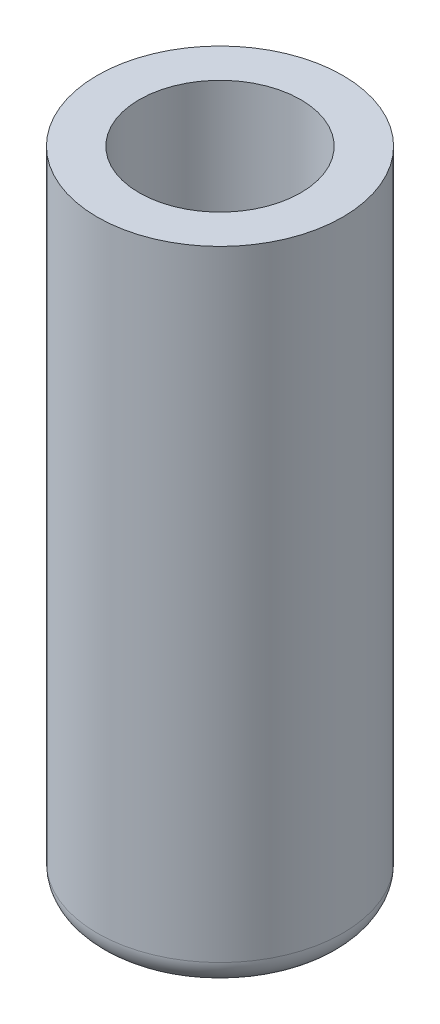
ISO-10303-21;
HEADER;
FILE_DESCRIPTION(('STEP AP214'),'2;1');
FILE_NAME('part.step','',(''),(''),'','','');
FILE_SCHEMA(('AUTOMOTIVE_DESIGN { 1 0 10303 214 1 1 1 1 }'));
ENDSEC;
DATA;
#1=APPLICATION_CONTEXT('core data for automotive mechanical design processes');
#2=APPLICATION_PROTOCOL_DEFINITION('international standard','automotive_design',2000,#1);
#3=PRODUCT_CONTEXT('',#1,'mechanical');
#4=PRODUCT('Part','Part','',(#3));
#5=PRODUCT_RELATED_PRODUCT_CATEGORY('part','',(#4));
#6=PRODUCT_DEFINITION_FORMATION('','',#4);
#7=PRODUCT_DEFINITION_CONTEXT('part definition',#1,'design');
#8=PRODUCT_DEFINITION('design','',#6,#7);
#9=PRODUCT_DEFINITION_SHAPE('','',#8);
#10=(LENGTH_UNIT() NAMED_UNIT(*) SI_UNIT(.MILLI.,.METRE.));
#11=(NAMED_UNIT(*) PLANE_ANGLE_UNIT() SI_UNIT($,.RADIAN.));
#12=(NAMED_UNIT(*) SI_UNIT($,.STERADIAN.) SOLID_ANGLE_UNIT());
#13=UNCERTAINTY_MEASURE_WITH_UNIT(LENGTH_MEASURE(1.E-05),#10,'distance_accuracy_value','');
#14=(GEOMETRIC_REPRESENTATION_CONTEXT(3) GLOBAL_UNCERTAINTY_ASSIGNED_CONTEXT((#13)) GLOBAL_UNIT_ASSIGNED_CONTEXT((#10,
#11,#12)) REPRESENTATION_CONTEXT('',''));
#15=CARTESIAN_POINT('',(0.,0.,0.));
#16=DIRECTION('',(0.,0.,1.));
#17=DIRECTION('',(1.,0.,0.));
#18=AXIS2_PLACEMENT_3D('',#15,#16,#17);
#19=CARTESIAN_POINT('',(0.,6.34999999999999,0.));
#20=DIRECTION('',(0.,-1.,0.));
#21=DIRECTION('',(0.,0.,-1.));
#22=AXIS2_PLACEMENT_3D('',#19,#20,#21);
#23=CYLINDRICAL_SURFACE('',#22,2.413);
#24=CARTESIAN_POINT('',(0.,-5.842,0.));
#25=DIRECTION('',(0.,1.,0.));
#26=DIRECTION('',(0.,0.,1.));
#27=AXIS2_PLACEMENT_3D('',#24,#25,#26);
#28=CIRCLE('',#27,2.413);
#29=CARTESIAN_POINT('',(0.,-5.842,2.41300000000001));
#30=VERTEX_POINT('',#29);
#31=EDGE_CURVE('E28',#30,#30,#28,.T.);
#32=ORIENTED_EDGE('',*,*,#31,.T.);
#33=EDGE_LOOP('',(#32));
#34=FACE_BOUND('',#33,.T.);
#35=CARTESIAN_POINT('',(0.,6.34999999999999,0.));
#36=DIRECTION('',(0.,1.,0.));
#37=DIRECTION('',(0.,0.,1.));
#38=AXIS2_PLACEMENT_3D('',#35,#36,#37);
#39=CIRCLE('',#38,2.413);
#40=CARTESIAN_POINT('',(0.,6.34999999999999,2.413));
#41=VERTEX_POINT('',#40);
#42=EDGE_CURVE('E32',#41,#41,#39,.T.);
#43=ORIENTED_EDGE('',*,*,#42,.F.);
#44=EDGE_LOOP('',(#43));
#45=FACE_BOUND('',#44,.T.);
#46=ADVANCED_FACE('F22',(#34,#45),#23,.T.);
#47=CARTESIAN_POINT('',(0.,6.34999999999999,0.));
#48=DIRECTION('',(0.,1.,0.));
#49=DIRECTION('',(0.,0.,1.));
#50=AXIS2_PLACEMENT_3D('',#47,#48,#49);
#51=PLANE('',#50);
#52=CARTESIAN_POINT('',(0.,6.34999999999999,0.));
#53=DIRECTION('',(0.,1.,0.));
#54=DIRECTION('',(0.,0.,1.));
#55=AXIS2_PLACEMENT_3D('',#52,#53,#54);
#56=CIRCLE('',#55,1.5875);
#57=CARTESIAN_POINT('',(0.,6.34999999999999,1.5875));
#58=VERTEX_POINT('',#57);
#59=EDGE_CURVE('E41',#58,#58,#56,.T.);
#60=ORIENTED_EDGE('',*,*,#59,.F.);
#61=EDGE_LOOP('',(#60));
#62=FACE_BOUND('',#61,.T.);
#63=ORIENTED_EDGE('',*,*,#42,.T.);
#64=EDGE_LOOP('',(#63));
#65=FACE_BOUND('',#64,.T.);
#66=ADVANCED_FACE('F47',(#62,#65),#51,.T.);
#67=CARTESIAN_POINT('',(0.,-6.34999999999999,0.));
#68=DIRECTION('',(0.,1.,0.));
#69=DIRECTION('',(0.,0.,1.));
#70=AXIS2_PLACEMENT_3D('',#67,#68,#69);
#71=PLANE('',#70);
#72=CARTESIAN_POINT('',(0.,-6.34999999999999,0.));
#73=DIRECTION('',(0.,1.,0.));
#74=DIRECTION('',(0.,0.,1.));
#75=AXIS2_PLACEMENT_3D('',#72,#73,#74);
#76=CIRCLE('',#75,1.905);
#77=CARTESIAN_POINT('',(0.,-6.34999999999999,1.90500000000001));
#78=VERTEX_POINT('',#77);
#79=EDGE_CURVE('E10',#78,#78,#76,.F.);
#80=ORIENTED_EDGE('',*,*,#79,.T.);
#81=EDGE_LOOP('',(#80));
#82=FACE_BOUND('',#81,.T.);
#83=CARTESIAN_POINT('',(0.,-6.34999999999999,0.));
#84=DIRECTION('',(0.,1.,0.));
#85=DIRECTION('',(0.,0.,1.));
#86=AXIS2_PLACEMENT_3D('',#83,#84,#85);
#87=CIRCLE('',#86,1.5875);
#88=CARTESIAN_POINT('',(0.,-6.34999999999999,1.58750000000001));
#89=VERTEX_POINT('',#88);
#90=EDGE_CURVE('E36',#89,#89,#87,.T.);
#91=ORIENTED_EDGE('',*,*,#90,.T.);
#92=EDGE_LOOP('',(#91));
#93=FACE_BOUND('',#92,.T.);
#94=ADVANCED_FACE('F50',(#82,#93),#71,.F.);
#95=CARTESIAN_POINT('',(0.,-6.34999999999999,0.));
#96=DIRECTION('',(0.,1.,0.));
#97=DIRECTION('',(0.,0.,1.));
#98=AXIS2_PLACEMENT_3D('',#95,#96,#97);
#99=CYLINDRICAL_SURFACE('',#98,1.5875);
#100=ORIENTED_EDGE('',*,*,#90,.F.);
#101=EDGE_LOOP('',(#100));
#102=FACE_BOUND('',#101,.T.);
#103=ORIENTED_EDGE('',*,*,#59,.T.);
#104=EDGE_LOOP('',(#103));
#105=FACE_BOUND('',#104,.T.);
#106=ADVANCED_FACE('F45',(#102,#105),#99,.F.);
#107=CARTESIAN_POINT('',(0.,-5.842,0.));
#108=DIRECTION('',(0.,1.,0.));
#109=DIRECTION('',(0.,0.,1.));
#110=AXIS2_PLACEMENT_3D('',#107,#108,#109);
#111=TOROIDAL_SURFACE('',#110,1.905,0.508);
#112=ORIENTED_EDGE('',*,*,#79,.F.);
#113=EDGE_LOOP('',(#112));
#114=FACE_BOUND('',#113,.T.);
#115=ORIENTED_EDGE('',*,*,#31,.F.);
#116=EDGE_LOOP('',(#115));
#117=FACE_BOUND('',#116,.T.);
#118=ADVANCED_FACE('F72',(#114,#117),#111,.T.);
#119=CLOSED_SHELL('',(#46,#66,#94,#106,#118));
#120=MANIFOLD_SOLID_BREP('B2',#119);
#121=ADVANCED_BREP_SHAPE_REPRESENTATION('',(#18,#120),#14);
#122=SHAPE_DEFINITION_REPRESENTATION(#9,#121);
ENDSEC;
END-ISO-10303-21;
